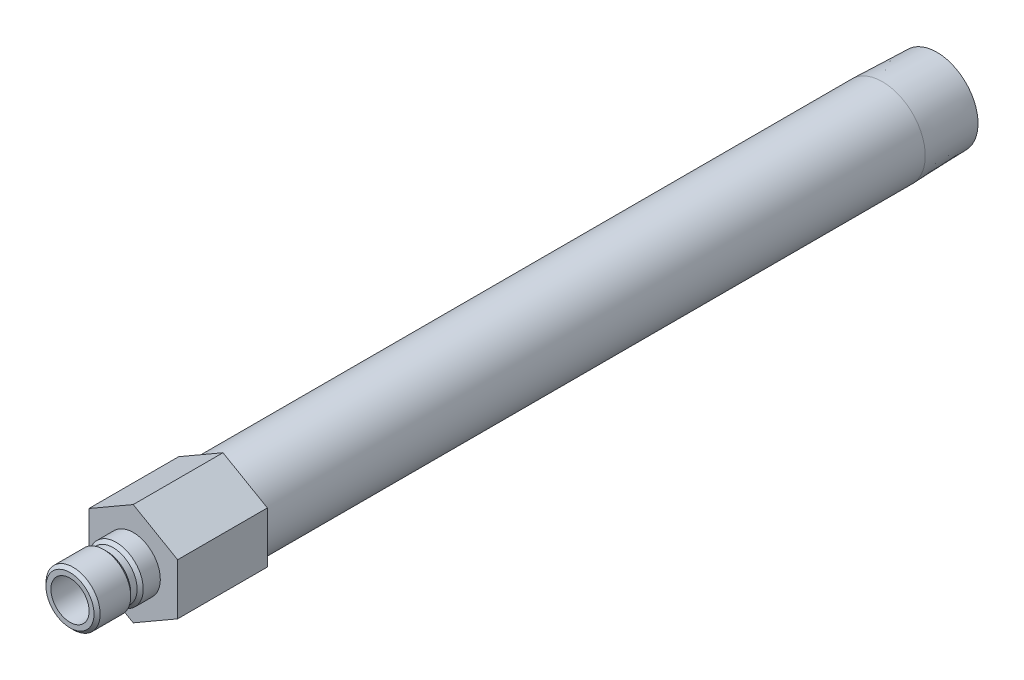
from build123d import *

# Parameters (mm, degrees)
SKETCH2_R           = 4.7625
BOSS_EXTRUDE1_DEPTH = 22.352


with BuildPart() as part:
    # Sketch1 → Revolve1 (revolve)
    with BuildSketch(Plane(origin=(0, 0, 0), x_dir=(0, 0, -1), z_dir=(1, 0, 0))):
        Polygon((-15.748, 4.7625), (-15.748, 5.9817), (-14.986, 6.7437), (-7.366, 6.7437), (-6.604, 5.9817), (-5.0165, 5.9817), (-4.2545, 6.7437), (0, 6.7437), (0, 10.668), (186.5884, 10.668), (200.152, 10.244140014), (200.152, 7.8994), (22.352, 7.8994), (22.352, 4.7625), align=None)
    revolve(axis=Axis((0, 0, 0), (0, 0, 1)))

    # Sketch2 → Boss-Extrude1 (add)
    with BuildSketch(Plane.XY):
        Polygon((-11.049, 6.379143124), (-11.049, -6.379143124), (0, -12.758286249), (11.049, -6.379143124), (11.049, 6.379143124), (0, 12.758286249), align=None)
        with Locations(Location((0, 0, 0), (0, 0, 90))):
            Circle(SKETCH2_R, mode=Mode.SUBTRACT)
    extrude(amount=-BOSS_EXTRUDE1_DEPTH)


solid = part.part
